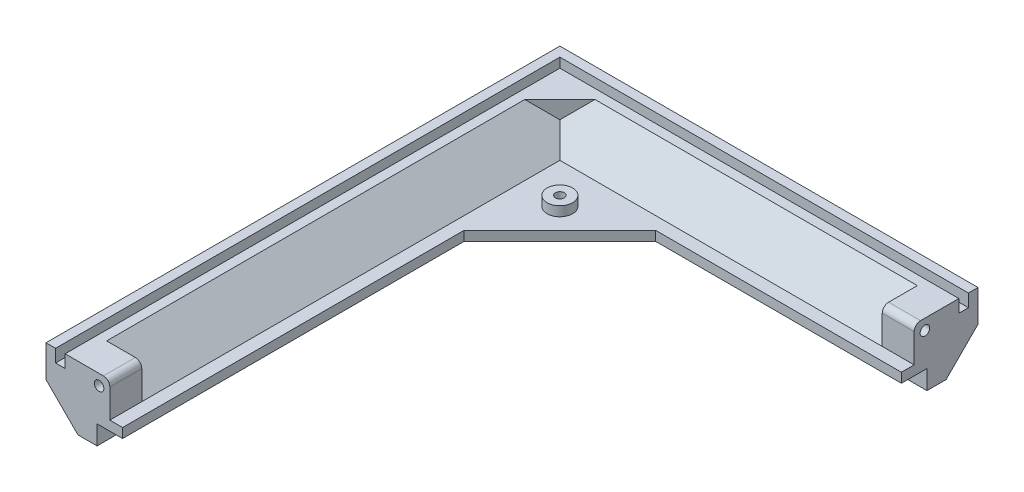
from build123d import *

# Parameters (mm, degrees)
BOSS_EXTRUDE2_DEPTH  = 141
BOSS_EXTRUDE3_DEPTH  = 111
SKETCH17_W           = 20
SKETCH17_H           = 20
BOSS_EXTRUDE9_DEPTH  = 20
SKETCH8_W            = 4
SKETCH8_H            = 3
CUT_EXTRUDE4_DEPTH   = 4
SKETCH9_W            = 3
SKETCH9_H            = 4
CUT_EXTRUDE5_DEPTH   = 17
SKETCH18_W           = 3
SKETCH18_H           = 4
CUT_EXTRUDE9_DEPTH   = 14
CUT_EXTRUDE7_DEPTH   = 11
BOSS_EXTRUDE5_DEPTH  = 10
BOSS_EXTRUDE6_DEPTH  = 10
CUT_EXTRUDE8_DEPTH   = 165.596839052
SKETCH15_W           = 111
SKETCH15_H           = 3
BOSS_EXTRUDE7_DEPTH  = 4
SKETCH16_W           = 137
SKETCH16_H           = 3
BOSS_EXTRUDE8_DEPTH  = 4
CHAMFER1_SIZE        = 30
CUT_EXTRUDE10_DEPTH  = 186.718425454
CUT_EXTRUDE11_DEPTH  = 160.103066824
CHAMFER2_SIZE        = 20
SKETCH21_R           = 1.4
CUT_EXTRUDE12_DEPTH  = 165.314087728
SKETCH22_R           = 1.5
BOSS_EXTRUDE10_DEPTH = 10
SKETCH23_R           = 1.5
BOSS_EXTRUDE11_DEPTH = 10
FILLET1_R            = 2
ESQUISSE1_R          = 4
ESQUISSE1_R_2        = 1.4
BOSS_EXTRU_1_DEPTH   = 3


with BuildPart() as part:
    # Sketch2 → Boss-Extrude2 (new body)
    with BuildSketch(Plane.XY.offset(6.547733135)):
        Polygon((-60.05786955, -10), (-60.05786955, 0), (-57.05786955, 0), (-57.05786955, -4), (-54.05786955, -4), (-54.05786955, 0), (-51.05786955, 0), (-40.05786955, -11), (-40.05786955, -14), (-44.05786955, -14), (-44.05786955, -17), (-40.05786955, -17), (-40.05786955, -20), (-50.05786955, -20), align=None)
    extrude(amount=BOSS_EXTRUDE2_DEPTH)



with BuildPart() as body_2:
    # Sketch3 → Boss-Extrude3 (new body)
    with BuildSketch(Plane(origin=(-40.05786955, 0, 0), x_dir=(0, 0, -1), z_dir=(1, 0, 0))):
        Polygon((-6.547733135, -14), (-2.547733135, -14), (-2.547733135, -17), (-6.547733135, -17), (-6.547733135, -20), (3.452266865, -20), (13.452266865, -10), (13.452266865, 0), (10.452266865, 0), (10.452266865, -4), (7.452266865, -4), (7.452266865, 0), (4.452266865, 0), (-6.547733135, -11), align=None)
    extrude(amount=BOSS_EXTRUDE3_DEPTH)


with BuildPart() as part_1:
    add(part.part)

    add(body_2.part)  # Boss-Extrude9 merges body 2
    # Sketch17 → Boss-Extrude9 (add)
    with BuildSketch(Plane(origin=(0, 0, 0), x_dir=(1, 0, 0), z_dir=(0, 1, 0))):
        with Locations((-50.05786955, 3.452266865)):
            Rectangle(SKETCH17_W, SKETCH17_H)
    extrude(amount=-BOSS_EXTRUDE9_DEPTH)

    # Sketch8 → Cut-Extrude4 (cut)
    with BuildSketch(Plane(origin=(-40.05786955, 0, 0), x_dir=(0, 0, -1), z_dir=(1, 0, 0))):
        with Locations((-4.547733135, -15.5)):
            Rectangle(SKETCH8_W, SKETCH8_H)
    extrude(amount=-CUT_EXTRUDE4_DEPTH, mode=Mode.SUBTRACT)

    # Sketch9 → Cut-Extrude5 (cut)
    with BuildSketch(Plane(origin=(-40.05786955, 0, 0), x_dir=(0, 0, -1), z_dir=(1, 0, 0))):
        with Locations((8.952266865, -2)):
            Rectangle(SKETCH9_W, SKETCH9_H)
    extrude(amount=-CUT_EXTRUDE5_DEPTH, mode=Mode.SUBTRACT)

    # Sketch18 → Cut-Extrude9 (cut)
    with BuildSketch(Plane.XY.offset(6.547733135)):
        with Locations((-55.55786955, -2)):
            Rectangle(SKETCH18_W, SKETCH18_H)
    extrude(amount=-CUT_EXTRUDE9_DEPTH, mode=Mode.SUBTRACT)

    # Sketch11 → Cut-Extrude7 (cut)
    with BuildSketch(Plane(origin=(0, 0, 0), x_dir=(1, 0, 0), z_dir=(0, 1, 0))):
        Polygon((-40.05786955, 4.452266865), (-51.05786955, -6.547733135), (-40.05786955, -6.547733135), align=None)
    extrude(amount=-CUT_EXTRUDE7_DEPTH, mode=Mode.SUBTRACT)

    # Sketch12 → Boss-Extrude5 (add)
    with BuildSketch(Plane.ZY.offset(40.05786955)):
        Polygon((-4.452266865, 0), (6.547733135, -11), (-4.452266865, -11), align=None)
    extrude(amount=BOSS_EXTRUDE5_DEPTH)

    # Sketch13 → Boss-Extrude6 (add)
    with BuildSketch(Plane(origin=(0, 0, 6.547733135), x_dir=(-1, 0, 0), z_dir=(0, 0, -1))):
        Polygon((40.05786955, -11), (51.05786955, -11), (51.05786955, 0), align=None)
    extrude(amount=BOSS_EXTRUDE6_DEPTH)

    # Sketch14 → Cut-Extrude8 (cut, through all)
    with BuildSketch(Plane(origin=(0, -17, 0), x_dir=(1, 0, 0), z_dir=(0, 1, 0))):
        Polygon((-44.05786955, -2.547733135), (-44.05786955, -147.547733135), (-40.05786955, -147.547733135), (-40.05786955, -6.547733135), (70.94213045, -6.547733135), (70.94213045, -2.547733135), align=None)
    extrude(amount=-CUT_EXTRUDE8_DEPTH, mode=Mode.SUBTRACT)

    # Sketch15 → Boss-Extrude7 (add)
    with BuildSketch(Plane.XY.offset(6.547733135)):
        with Locations((15.44213045, -12.5)):
            Rectangle(SKETCH15_W, SKETCH15_H)
    extrude(amount=BOSS_EXTRUDE7_DEPTH)

    # Sketch16 → Boss-Extrude8 (add)
    with BuildSketch(Plane(origin=(-40.05786955, 0, 0), x_dir=(0, 0, -1), z_dir=(1, 0, 0))):
        with Locations((-79.047733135, -12.5)):
            Rectangle(SKETCH16_W, SKETCH16_H)
    extrude(amount=BOSS_EXTRUDE8_DEPTH)

    # Chamfer1
    chamfer1_edges = [part_1.edges().sort_by_distance(p)[0] for p in [
        (-36.05786955, -12.5, 10.547733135),
    ]]
    chamfer(chamfer1_edges, length=CHAMFER1_SIZE)

    # Sketch19 → Cut-Extrude10 (cut, through all)
    with BuildSketch(Plane(origin=(-40.05786955, 0, 0), x_dir=(0, 0, -1), z_dir=(1, 0, 0))):
        Polygon((13.452266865, -10), (3.452266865, -20), (13.452266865, -20), align=None)
    extrude(amount=-CUT_EXTRUDE10_DEPTH, mode=Mode.SUBTRACT)

    # Sketch20 → Cut-Extrude11 (cut, through all)
    with BuildSketch(Plane.XY.offset(6.547733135)):
        Polygon((-50.05786955, -20), (-60.05786955, -10), (-60.05786955, -20), align=None)
    extrude(amount=-CUT_EXTRUDE11_DEPTH, mode=Mode.SUBTRACT)

    # Chamfer2
    chamfer2_edges = [part_1.edges().sort_by_distance(p)[0] for p in [
        (-44.05786955, -17, 2.547733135),
    ]]
    chamfer(chamfer2_edges, length=CHAMFER2_SIZE)

    # Sketch21 → Cut-Extrude12 (cut, through all)
    with BuildSketch(Plane.XZ.offset(14)):
        with Locations(Location((-27.55786955, 19.047733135, 0), (0, 0, 270))):
            Circle(SKETCH21_R)
    extrude(amount=-CUT_EXTRUDE12_DEPTH, mode=Mode.SUBTRACT)

    # Sketch22 → Boss-Extrude10 (add)
    with BuildSketch(Plane(origin=(70.94213045, 0, 0), x_dir=(0, 0, -1), z_dir=(1, 0, 0))):
        Polygon((-6.547733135, -11), (-6.547733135, 0), (4.452266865, 0), align=None)
        with Locations((-3.169053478, -3.378679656)):
            Circle(SKETCH22_R, mode=Mode.SUBTRACT)
    extrude(amount=-BOSS_EXTRUDE10_DEPTH)

    # Sketch23 → Boss-Extrude11 (add)
    with BuildSketch(Plane.XY.offset(147.547733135)):
        Polygon((-40.05786955, -11), (-51.05786955, 0), (-40.05786955, 0), align=None)
        with Locations((-43.436549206, -3.378679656)):
            Circle(SKETCH23_R, mode=Mode.SUBTRACT)
    extrude(amount=-BOSS_EXTRUDE11_DEPTH)

    # Fillet1
    fillet1_edges = [part_1.edges().sort_by_distance(p)[0] for p in [
        (65.94213045, 0, 6.547733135),
        (-40.05786955, 0, 142.547733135),
    ]]
    fillet(fillet1_edges, radius=FILLET1_R)

    # Esquisse1 → Boss.-Extru.1 (add)
    with BuildSketch(Plane(origin=(0, -11, 0), x_dir=(1, 0, 0), z_dir=(0, 1, 0))):
        with Locations(Location((-27.55786955, -19.047733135, 0), (0, 0, 90))):
            Circle(ESQUISSE1_R)
        with Locations(Location((-27.55786955, -19.047733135, 0), (0, 0, 90))):
            Circle(ESQUISSE1_R_2, mode=Mode.SUBTRACT)
    extrude(amount=BOSS_EXTRU_1_DEPTH)


solid = part_1.part
